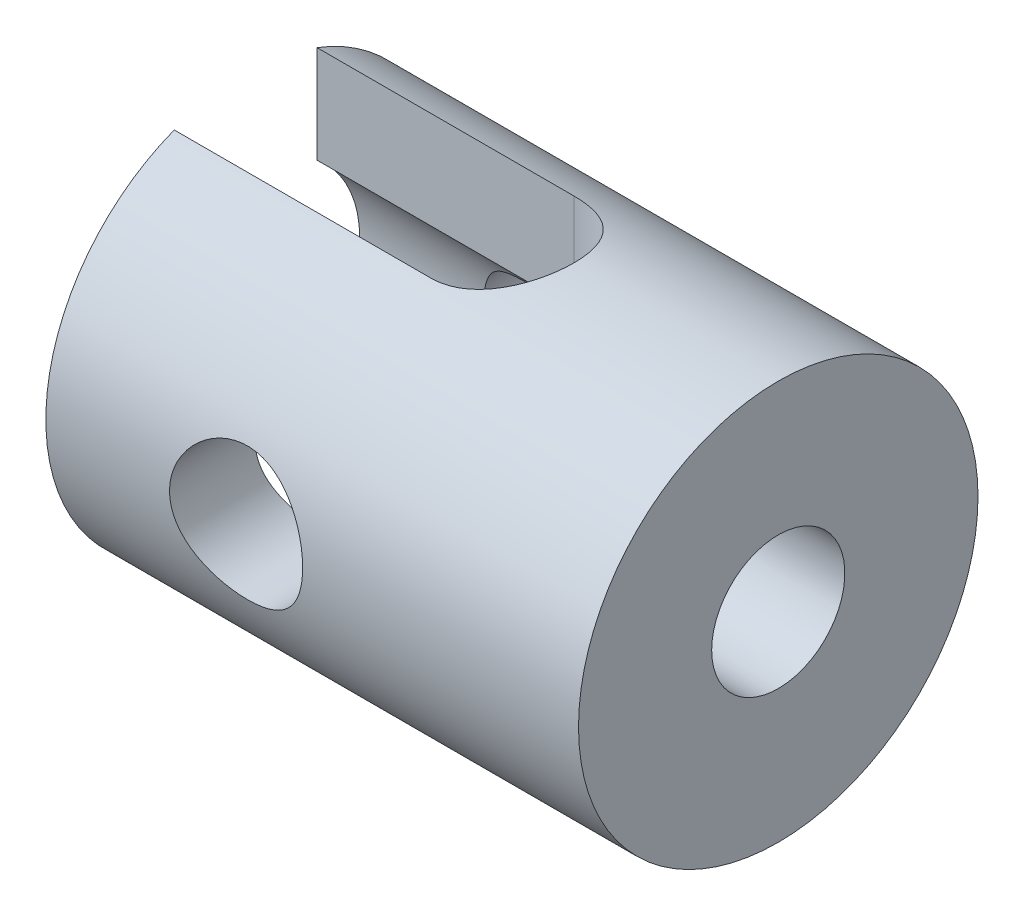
from build123d import *

# Parameters (mm, degrees)
SKETCH_1_R               = 84
EXTRUDE_1_DEPTH          = 224
CUT_EXTRUDE_1_DEPTH      = 254.550783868
CUT_EXTRUDE_1_DEPTH_BACK = 254.550783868
SKETCH_3_R               = 28
CUT_EXTRUDE_2_DEPTH      = 254.550784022
SKETCH_4_R               = 48
CUT_EXTRUDE_3_DEPTH      = 172
CUT_EXTRUDE_4_DEPTH      = 224
CUT_EXTRUDE_4_DEPTH_BACK = 254.550784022
SKETCH_5_R               = 28


with BuildPart() as part:
    # Sketch 1 → Extrude 1 (new body)
    with BuildSketch(Plane(origin=(0, 0, 0), x_dir=(0, 0, -1), z_dir=(1, 0, 0))):
        Circle(SKETCH_1_R)
    extrude(amount=-EXTRUDE_1_DEPTH)

    # Sketch 2 → Cut-Extrude 1 (cut, two sides: drawn at the far end of the back side and taken through both)
    with BuildSketch(Plane(origin=(0, 0, 0), x_dir=(1, 0, 0), z_dir=(0, 1, 0)).offset(-CUT_EXTRUDE_1_DEPTH_BACK)):
        with BuildLine():
            Line((-241.553206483, 30), (-116, 30))
            ThreePointArc((-116, 30), (-86, 0), (-116, -30))
            Line((-116, -30), (-241.553206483, -30))
            Line((-241.553206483, -30), (-241.553206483, 30))
        make_face()
    extrude(amount=CUT_EXTRUDE_1_DEPTH + CUT_EXTRUDE_1_DEPTH_BACK, mode=Mode.SUBTRACT)

    # Sketch 3 → Cut-Extrude 2 (cut, through all)
    with BuildSketch(Plane.ZY.offset(224)):
        Circle(SKETCH_3_R)
    extrude(amount=-CUT_EXTRUDE_2_DEPTH, mode=Mode.SUBTRACT)

    # Sketch 4 → Cut-Extrude 3 (cut)
    with BuildSketch(Plane.ZY.offset(224)):
        Circle(SKETCH_4_R)
    extrude(amount=-CUT_EXTRUDE_3_DEPTH, mode=Mode.SUBTRACT)

    # Sketch 5 → Cut-Extrude 4 (cut, two sides: drawn at the far end of the back side and taken through both)
    with BuildSketch(Plane.XY.offset(-CUT_EXTRUDE_4_DEPTH_BACK)):
        with Locations(Location((-144, 0, 0), (0, 0, 180))):
            Circle(SKETCH_5_R)
    extrude(amount=CUT_EXTRUDE_4_DEPTH + CUT_EXTRUDE_4_DEPTH_BACK, mode=Mode.SUBTRACT)


solid = part.part
